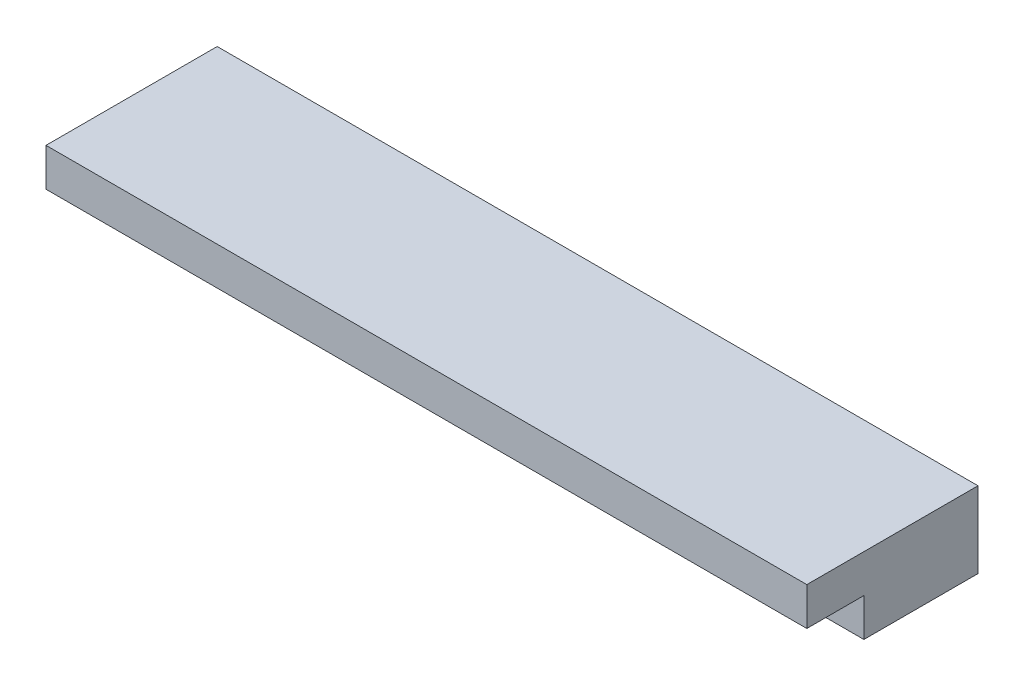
ISO-10303-21;
HEADER;
FILE_DESCRIPTION(('STEP AP214'),'2;1');
FILE_NAME('part.step','',(''),(''),'','','');
FILE_SCHEMA(('AUTOMOTIVE_DESIGN { 1 0 10303 214 1 1 1 1 }'));
ENDSEC;
DATA;
#1=APPLICATION_CONTEXT('core data for automotive mechanical design processes');
#2=APPLICATION_PROTOCOL_DEFINITION('international standard','automotive_design',2000,#1);
#3=PRODUCT_CONTEXT('',#1,'mechanical');
#4=PRODUCT('Part','Part','',(#3));
#5=PRODUCT_RELATED_PRODUCT_CATEGORY('part','',(#4));
#6=PRODUCT_DEFINITION_FORMATION('','',#4);
#7=PRODUCT_DEFINITION_CONTEXT('part definition',#1,'design');
#8=PRODUCT_DEFINITION('design','',#6,#7);
#9=PRODUCT_DEFINITION_SHAPE('','',#8);
#10=(LENGTH_UNIT() NAMED_UNIT(*) SI_UNIT(.MILLI.,.METRE.));
#11=(NAMED_UNIT(*) PLANE_ANGLE_UNIT() SI_UNIT($,.RADIAN.));
#12=(NAMED_UNIT(*) SI_UNIT($,.STERADIAN.) SOLID_ANGLE_UNIT());
#13=UNCERTAINTY_MEASURE_WITH_UNIT(LENGTH_MEASURE(1.E-05),#10,'distance_accuracy_value','');
#14=(GEOMETRIC_REPRESENTATION_CONTEXT(3) GLOBAL_UNCERTAINTY_ASSIGNED_CONTEXT((#13)) GLOBAL_UNIT_ASSIGNED_CONTEXT((#10,
#11,#12)) REPRESENTATION_CONTEXT('',''));
#15=CARTESIAN_POINT('',(0.,0.,0.));
#16=DIRECTION('',(0.,0.,1.));
#17=DIRECTION('',(1.,0.,0.));
#18=AXIS2_PLACEMENT_3D('',#15,#16,#17);
#19=CARTESIAN_POINT('',(20.,0.,-6.));
#20=DIRECTION('',(0.,1.,0.));
#21=DIRECTION('',(0.,0.,1.));
#22=AXIS2_PLACEMENT_3D('',#19,#20,#21);
#23=PLANE('',#22);
#24=DIRECTION('',(0.,0.,-1.));
#25=VECTOR('',#24,1.);
#26=CARTESIAN_POINT('',(-20.,0.,-6.));
#27=LINE('',#26,#25);
#28=CARTESIAN_POINT('',(-20.,0.,0.));
#29=VERTEX_POINT('',#28);
#30=CARTESIAN_POINT('',(-20.,0.,-6.));
#31=VERTEX_POINT('',#30);
#32=EDGE_CURVE('E119',#29,#31,#27,.T.);
#33=ORIENTED_EDGE('',*,*,#32,.T.);
#34=DIRECTION('',(-1.,0.,0.));
#35=VECTOR('',#34,1.);
#36=CARTESIAN_POINT('',(20.,0.,-6.));
#37=LINE('',#36,#35);
#38=CARTESIAN_POINT('',(20.,0.,-6.));
#39=VERTEX_POINT('',#38);
#40=EDGE_CURVE('E11',#39,#31,#37,.T.);
#41=ORIENTED_EDGE('',*,*,#40,.F.);
#42=DIRECTION('',(0.,0.,-1.));
#43=VECTOR('',#42,1.);
#44=CARTESIAN_POINT('',(20.,0.,-6.));
#45=LINE('',#44,#43);
#46=CARTESIAN_POINT('',(20.,0.,0.));
#47=VERTEX_POINT('',#46);
#48=EDGE_CURVE('E129',#47,#39,#45,.T.);
#49=ORIENTED_EDGE('',*,*,#48,.F.);
#50=DIRECTION('',(-1.,0.,0.));
#51=VECTOR('',#50,1.);
#52=CARTESIAN_POINT('',(20.,0.,0.));
#53=LINE('',#52,#51);
#54=EDGE_CURVE('E115',#47,#29,#53,.T.);
#55=ORIENTED_EDGE('',*,*,#54,.T.);
#56=EDGE_LOOP('',(#33,#41,#49,#55));
#57=FACE_BOUND('',#56,.T.);
#58=ADVANCED_FACE('F35',(#57),#23,.F.);
#59=CARTESIAN_POINT('',(20.,4.,-6.));
#60=DIRECTION('',(0.,0.,1.));
#61=DIRECTION('',(0.,-1.,0.));
#62=AXIS2_PLACEMENT_3D('',#59,#60,#61);
#63=PLANE('',#62);
#64=DIRECTION('',(0.,1.,0.));
#65=VECTOR('',#64,1.);
#66=CARTESIAN_POINT('',(-20.,4.,-6.));
#67=LINE('',#66,#65);
#68=CARTESIAN_POINT('',(-20.,4.,-6.));
#69=VERTEX_POINT('',#68);
#70=EDGE_CURVE('E122',#31,#69,#67,.T.);
#71=ORIENTED_EDGE('',*,*,#70,.T.);
#72=DIRECTION('',(-1.,0.,0.));
#73=VECTOR('',#72,1.);
#74=CARTESIAN_POINT('',(20.,4.,-6.));
#75=LINE('',#74,#73);
#76=CARTESIAN_POINT('',(20.,4.,-6.));
#77=VERTEX_POINT('',#76);
#78=EDGE_CURVE('E43',#77,#69,#75,.T.);
#79=ORIENTED_EDGE('',*,*,#78,.F.);
#80=DIRECTION('',(0.,1.,0.));
#81=VECTOR('',#80,1.);
#82=CARTESIAN_POINT('',(20.,4.,-6.));
#83=LINE('',#82,#81);
#84=EDGE_CURVE('E88',#39,#77,#83,.T.);
#85=ORIENTED_EDGE('',*,*,#84,.F.);
#86=ORIENTED_EDGE('',*,*,#40,.T.);
#87=EDGE_LOOP('',(#71,#79,#85,#86));
#88=FACE_BOUND('',#87,.T.);
#89=ADVANCED_FACE('F153',(#88),#63,.F.);
#90=CARTESIAN_POINT('',(20.,4.,3.));
#91=DIRECTION('',(0.,-1.,0.));
#92=DIRECTION('',(0.,0.,-1.));
#93=AXIS2_PLACEMENT_3D('',#90,#91,#92);
#94=PLANE('',#93);
#95=DIRECTION('',(0.,0.,1.));
#96=VECTOR('',#95,1.);
#97=CARTESIAN_POINT('',(-20.,4.,3.));
#98=LINE('',#97,#96);
#99=CARTESIAN_POINT('',(-20.,4.,3.));
#100=VERTEX_POINT('',#99);
#101=EDGE_CURVE('E124',#69,#100,#98,.T.);
#102=ORIENTED_EDGE('',*,*,#101,.T.);
#103=DIRECTION('',(-1.,0.,0.));
#104=VECTOR('',#103,1.);
#105=CARTESIAN_POINT('',(20.,4.,3.));
#106=LINE('',#105,#104);
#107=CARTESIAN_POINT('',(20.,4.,3.));
#108=VERTEX_POINT('',#107);
#109=EDGE_CURVE('E110',#108,#100,#106,.T.);
#110=ORIENTED_EDGE('',*,*,#109,.F.);
#111=DIRECTION('',(0.,0.,1.));
#112=VECTOR('',#111,1.);
#113=CARTESIAN_POINT('',(20.,4.,3.));
#114=LINE('',#113,#112);
#115=EDGE_CURVE('E101',#77,#108,#114,.T.);
#116=ORIENTED_EDGE('',*,*,#115,.F.);
#117=ORIENTED_EDGE('',*,*,#78,.T.);
#118=EDGE_LOOP('',(#102,#110,#116,#117));
#119=FACE_BOUND('',#118,.T.);
#120=ADVANCED_FACE('F135',(#119),#94,.F.);
#121=CARTESIAN_POINT('',(20.,2.,3.));
#122=DIRECTION('',(0.,0.,-1.));
#123=DIRECTION('',(-1.,0.,0.));
#124=AXIS2_PLACEMENT_3D('',#121,#122,#123);
#125=PLANE('',#124);
#126=DIRECTION('',(0.,-1.,0.));
#127=VECTOR('',#126,1.);
#128=CARTESIAN_POINT('',(-20.,2.,3.));
#129=LINE('',#128,#127);
#130=CARTESIAN_POINT('',(-20.,2.,3.));
#131=VERTEX_POINT('',#130);
#132=EDGE_CURVE('E109',#100,#131,#129,.T.);
#133=ORIENTED_EDGE('',*,*,#132,.T.);
#134=DIRECTION('',(-1.,0.,0.));
#135=VECTOR('',#134,1.);
#136=CARTESIAN_POINT('',(20.,2.,3.));
#137=LINE('',#136,#135);
#138=CARTESIAN_POINT('',(20.,2.,3.));
#139=VERTEX_POINT('',#138);
#140=EDGE_CURVE('E106',#139,#131,#137,.T.);
#141=ORIENTED_EDGE('',*,*,#140,.F.);
#142=DIRECTION('',(0.,-1.,0.));
#143=VECTOR('',#142,1.);
#144=CARTESIAN_POINT('',(20.,2.,3.));
#145=LINE('',#144,#143);
#146=EDGE_CURVE('E95',#108,#139,#145,.T.);
#147=ORIENTED_EDGE('',*,*,#146,.F.);
#148=ORIENTED_EDGE('',*,*,#109,.T.);
#149=EDGE_LOOP('',(#133,#141,#147,#148));
#150=FACE_BOUND('',#149,.T.);
#151=ADVANCED_FACE('F107',(#150),#125,.F.);
#152=CARTESIAN_POINT('',(20.,2.,0.));
#153=DIRECTION('',(0.,1.,0.));
#154=DIRECTION('',(0.,0.,1.));
#155=AXIS2_PLACEMENT_3D('',#152,#153,#154);
#156=PLANE('',#155);
#157=DIRECTION('',(0.,0.,-1.));
#158=VECTOR('',#157,1.);
#159=CARTESIAN_POINT('',(-20.,2.,0.));
#160=LINE('',#159,#158);
#161=CARTESIAN_POINT('',(-20.,2.,0.));
#162=VERTEX_POINT('',#161);
#163=EDGE_CURVE('E74',#131,#162,#160,.T.);
#164=ORIENTED_EDGE('',*,*,#163,.T.);
#165=DIRECTION('',(-1.,0.,0.));
#166=VECTOR('',#165,1.);
#167=CARTESIAN_POINT('',(20.,2.,0.));
#168=LINE('',#167,#166);
#169=CARTESIAN_POINT('',(20.,2.,0.));
#170=VERTEX_POINT('',#169);
#171=EDGE_CURVE('E111',#170,#162,#168,.T.);
#172=ORIENTED_EDGE('',*,*,#171,.F.);
#173=DIRECTION('',(0.,0.,-1.));
#174=VECTOR('',#173,1.);
#175=CARTESIAN_POINT('',(20.,2.,0.));
#176=LINE('',#175,#174);
#177=EDGE_CURVE('E99',#139,#170,#176,.T.);
#178=ORIENTED_EDGE('',*,*,#177,.F.);
#179=ORIENTED_EDGE('',*,*,#140,.T.);
#180=EDGE_LOOP('',(#164,#172,#178,#179));
#181=FACE_BOUND('',#180,.T.);
#182=ADVANCED_FACE('F113',(#181),#156,.F.);
#183=CARTESIAN_POINT('',(20.,0.,0.));
#184=DIRECTION('',(0.,0.,-1.));
#185=DIRECTION('',(-1.,0.,0.));
#186=AXIS2_PLACEMENT_3D('',#183,#184,#185);
#187=PLANE('',#186);
#188=DIRECTION('',(0.,-1.,0.));
#189=VECTOR('',#188,1.);
#190=CARTESIAN_POINT('',(-20.,0.,0.));
#191=LINE('',#190,#189);
#192=EDGE_CURVE('E80',#162,#29,#191,.T.);
#193=ORIENTED_EDGE('',*,*,#192,.T.);
#194=ORIENTED_EDGE('',*,*,#54,.F.);
#195=DIRECTION('',(0.,-1.,0.));
#196=VECTOR('',#195,1.);
#197=CARTESIAN_POINT('',(20.,0.,0.));
#198=LINE('',#197,#196);
#199=EDGE_CURVE('E51',#170,#47,#198,.T.);
#200=ORIENTED_EDGE('',*,*,#199,.F.);
#201=ORIENTED_EDGE('',*,*,#171,.T.);
#202=EDGE_LOOP('',(#193,#194,#200,#201));
#203=FACE_BOUND('',#202,.T.);
#204=ADVANCED_FACE('F142',(#203),#187,.F.);
#205=CARTESIAN_POINT('',(20.,0.,0.));
#206=DIRECTION('',(-1.,0.,0.));
#207=DIRECTION('',(0.,0.,1.));
#208=AXIS2_PLACEMENT_3D('',#205,#206,#207);
#209=PLANE('',#208);
#210=ORIENTED_EDGE('',*,*,#48,.T.);
#211=ORIENTED_EDGE('',*,*,#84,.T.);
#212=ORIENTED_EDGE('',*,*,#115,.T.);
#213=ORIENTED_EDGE('',*,*,#146,.T.);
#214=ORIENTED_EDGE('',*,*,#177,.T.);
#215=ORIENTED_EDGE('',*,*,#199,.T.);
#216=EDGE_LOOP('',(#210,#211,#212,#213,#214,#215));
#217=FACE_BOUND('',#216,.T.);
#218=ADVANCED_FACE('F97',(#217),#209,.F.);
#219=CARTESIAN_POINT('',(-20.,0.,0.));
#220=DIRECTION('',(-1.,0.,0.));
#221=DIRECTION('',(0.,0.,1.));
#222=AXIS2_PLACEMENT_3D('',#219,#220,#221);
#223=PLANE('',#222);
#224=ORIENTED_EDGE('',*,*,#32,.F.);
#225=ORIENTED_EDGE('',*,*,#192,.F.);
#226=ORIENTED_EDGE('',*,*,#163,.F.);
#227=ORIENTED_EDGE('',*,*,#132,.F.);
#228=ORIENTED_EDGE('',*,*,#101,.F.);
#229=ORIENTED_EDGE('',*,*,#70,.F.);
#230=EDGE_LOOP('',(#224,#225,#226,#227,#228,#229));
#231=FACE_BOUND('',#230,.T.);
#232=ADVANCED_FACE('F138',(#231),#223,.T.);
#233=CLOSED_SHELL('',(#58,#89,#120,#151,#182,#204,#218,#232));
#234=MANIFOLD_SOLID_BREP('B2',#233);
#235=ADVANCED_BREP_SHAPE_REPRESENTATION('',(#18,#234),#14);
#236=SHAPE_DEFINITION_REPRESENTATION(#9,#235);
ENDSEC;
END-ISO-10303-21;
